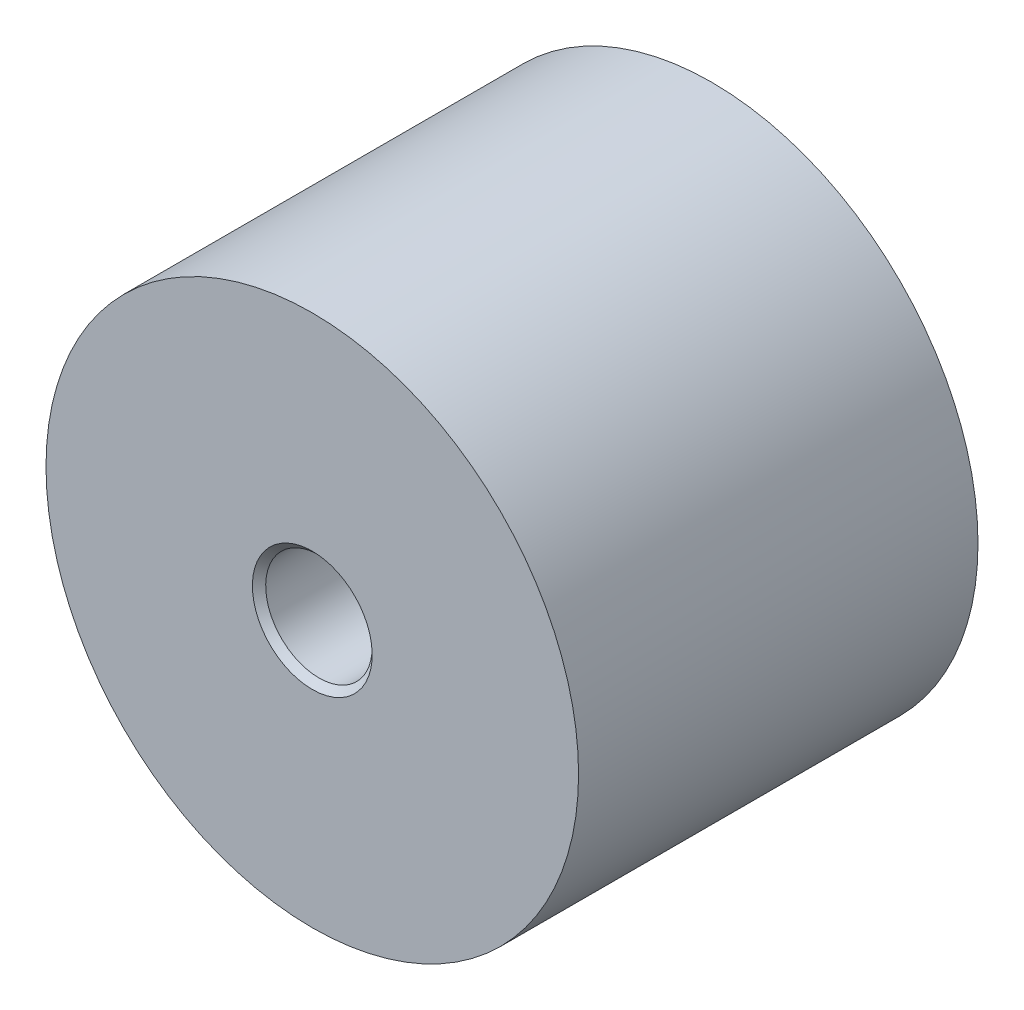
ISO-10303-21;
HEADER;
FILE_DESCRIPTION(('STEP AP214'),'2;1');
FILE_NAME('part.step','',(''),(''),'','','');
FILE_SCHEMA(('AUTOMOTIVE_DESIGN { 1 0 10303 214 1 1 1 1 }'));
ENDSEC;
DATA;
#1=APPLICATION_CONTEXT('core data for automotive mechanical design processes');
#2=APPLICATION_PROTOCOL_DEFINITION('international standard','automotive_design',2000,#1);
#3=PRODUCT_CONTEXT('',#1,'mechanical');
#4=PRODUCT('Part','Part','',(#3));
#5=PRODUCT_RELATED_PRODUCT_CATEGORY('part','',(#4));
#6=PRODUCT_DEFINITION_FORMATION('','',#4);
#7=PRODUCT_DEFINITION_CONTEXT('part definition',#1,'design');
#8=PRODUCT_DEFINITION('design','',#6,#7);
#9=PRODUCT_DEFINITION_SHAPE('','',#8);
#10=(LENGTH_UNIT() NAMED_UNIT(*) SI_UNIT(.MILLI.,.METRE.));
#11=(NAMED_UNIT(*) PLANE_ANGLE_UNIT() SI_UNIT($,.RADIAN.));
#12=(NAMED_UNIT(*) SI_UNIT($,.STERADIAN.) SOLID_ANGLE_UNIT());
#13=UNCERTAINTY_MEASURE_WITH_UNIT(LENGTH_MEASURE(1.E-05),#10,'distance_accuracy_value','');
#14=(GEOMETRIC_REPRESENTATION_CONTEXT(3) GLOBAL_UNCERTAINTY_ASSIGNED_CONTEXT((#13)) GLOBAL_UNIT_ASSIGNED_CONTEXT((#10,
#11,#12)) REPRESENTATION_CONTEXT('',''));
#15=CARTESIAN_POINT('',(0.,0.,0.));
#16=DIRECTION('',(0.,0.,1.));
#17=DIRECTION('',(1.,0.,0.));
#18=AXIS2_PLACEMENT_3D('',#15,#16,#17);
#19=CARTESIAN_POINT('',(18.666666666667,0.,30.));
#20=DIRECTION('',(0.,0.,1.));
#21=DIRECTION('',(0.,-1.,0.));
#22=AXIS2_PLACEMENT_3D('',#19,#20,#21);
#23=PLANE('',#22);
#24=CARTESIAN_POINT('',(0.,0.,30.));
#25=DIRECTION('',(0.,0.,1.));
#26=DIRECTION('',(0.,-1.,0.));
#27=AXIS2_PLACEMENT_3D('',#24,#25,#26);
#28=CIRCLE('',#27,4.5);
#29=CARTESIAN_POINT('',(0.,-4.5,30.));
#30=VERTEX_POINT('',#29);
#31=EDGE_CURVE('E8',#30,#30,#28,.F.);
#32=ORIENTED_EDGE('',*,*,#31,.T.);
#33=EDGE_LOOP('',(#32));
#34=FACE_BOUND('',#33,.T.);
#35=CARTESIAN_POINT('',(0.,0.,30.));
#36=DIRECTION('',(0.,0.,1.));
#37=DIRECTION('',(0.,-1.,0.));
#38=AXIS2_PLACEMENT_3D('',#35,#36,#37);
#39=CIRCLE('',#38,20.);
#40=CARTESIAN_POINT('',(0.,-20.,30.));
#41=VERTEX_POINT('',#40);
#42=EDGE_CURVE('E32',#41,#41,#39,.T.);
#43=ORIENTED_EDGE('',*,*,#42,.T.);
#44=EDGE_LOOP('',(#43));
#45=FACE_BOUND('',#44,.T.);
#46=ADVANCED_FACE('F12',(#34,#45),#23,.T.);
#47=CARTESIAN_POINT('',(0.,0.,1.));
#48=DIRECTION('',(0.,0.,1.));
#49=DIRECTION('',(0.,-1.,0.));
#50=AXIS2_PLACEMENT_3D('',#47,#48,#49);
#51=CYLINDRICAL_SURFACE('',#50,20.);
#52=CARTESIAN_POINT('',(0.,0.,0.));
#53=DIRECTION('',(0.,0.,1.));
#54=DIRECTION('',(0.,-1.,0.));
#55=AXIS2_PLACEMENT_3D('',#52,#53,#54);
#56=CIRCLE('',#55,20.);
#57=CARTESIAN_POINT('',(0.,-20.,0.));
#58=VERTEX_POINT('',#57);
#59=EDGE_CURVE('E35',#58,#58,#56,.T.);
#60=ORIENTED_EDGE('',*,*,#59,.T.);
#61=EDGE_LOOP('',(#60));
#62=FACE_BOUND('',#61,.T.);
#63=ORIENTED_EDGE('',*,*,#42,.F.);
#64=EDGE_LOOP('',(#63));
#65=FACE_BOUND('',#64,.T.);
#66=ADVANCED_FACE('F63',(#62,#65),#51,.T.);
#67=CARTESIAN_POINT('',(20.,0.,0.));
#68=DIRECTION('',(0.,0.,-1.));
#69=DIRECTION('',(0.,1.,0.));
#70=AXIS2_PLACEMENT_3D('',#67,#68,#69);
#71=PLANE('',#70);
#72=CARTESIAN_POINT('',(0.,0.,0.));
#73=DIRECTION('',(0.,0.,-1.));
#74=DIRECTION('',(0.,1.,0.));
#75=AXIS2_PLACEMENT_3D('',#72,#73,#74);
#76=CIRCLE('',#75,4.5);
#77=CARTESIAN_POINT('',(0.,4.5,0.));
#78=VERTEX_POINT('',#77);
#79=EDGE_CURVE('E23',#78,#78,#76,.F.);
#80=ORIENTED_EDGE('',*,*,#79,.T.);
#81=EDGE_LOOP('',(#80));
#82=FACE_BOUND('',#81,.T.);
#83=ORIENTED_EDGE('',*,*,#59,.F.);
#84=EDGE_LOOP('',(#83));
#85=FACE_BOUND('',#84,.T.);
#86=ADVANCED_FACE('F68',(#82,#85),#71,.T.);
#87=CARTESIAN_POINT('',(0.,0.,0.));
#88=DIRECTION('',(0.,0.,1.));
#89=DIRECTION('',(0.,-1.,0.));
#90=AXIS2_PLACEMENT_3D('',#87,#88,#89);
#91=CYLINDRICAL_SURFACE('',#90,4.);
#92=CARTESIAN_POINT('',(0.,0.,0.50000000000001));
#93=DIRECTION('',(0.,0.,-1.));
#94=DIRECTION('',(0.,1.,0.));
#95=AXIS2_PLACEMENT_3D('',#92,#93,#94);
#96=CIRCLE('',#95,4.);
#97=CARTESIAN_POINT('',(0.,4.,0.50000000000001));
#98=VERTEX_POINT('',#97);
#99=EDGE_CURVE('E27',#98,#98,#96,.T.);
#100=ORIENTED_EDGE('',*,*,#99,.T.);
#101=EDGE_LOOP('',(#100));
#102=FACE_BOUND('',#101,.T.);
#103=CARTESIAN_POINT('',(0.,0.,8.));
#104=DIRECTION('',(0.,0.,-1.));
#105=DIRECTION('',(0.,1.,0.));
#106=AXIS2_PLACEMENT_3D('',#103,#104,#105);
#107=CIRCLE('',#106,4.);
#108=CARTESIAN_POINT('',(0.,4.,8.));
#109=VERTEX_POINT('',#108);
#110=EDGE_CURVE('E38',#109,#109,#107,.T.);
#111=ORIENTED_EDGE('',*,*,#110,.F.);
#112=EDGE_LOOP('',(#111));
#113=FACE_BOUND('',#112,.T.);
#114=ADVANCED_FACE('F58',(#102,#113),#91,.F.);
#115=CARTESIAN_POINT('',(0.,0.,8.));
#116=DIRECTION('',(0.,0.,-1.));
#117=DIRECTION('',(0.,1.,0.));
#118=AXIS2_PLACEMENT_3D('',#115,#116,#117);
#119=PLANE('',#118);
#120=ORIENTED_EDGE('',*,*,#110,.T.);
#121=EDGE_LOOP('',(#120));
#122=FACE_BOUND('',#121,.T.);
#123=ADVANCED_FACE('F49',(#122),#119,.T.);
#124=CARTESIAN_POINT('',(0.,0.,24.666666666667));
#125=DIRECTION('',(0.,0.,1.));
#126=DIRECTION('',(0.,-1.,0.));
#127=AXIS2_PLACEMENT_3D('',#124,#125,#126);
#128=CYLINDRICAL_SURFACE('',#127,4.);
#129=CARTESIAN_POINT('',(0.,0.,29.5));
#130=DIRECTION('',(0.,0.,1.));
#131=DIRECTION('',(0.,-1.,0.));
#132=AXIS2_PLACEMENT_3D('',#129,#130,#131);
#133=CIRCLE('',#132,4.);
#134=CARTESIAN_POINT('',(0.,-4.,29.5));
#135=VERTEX_POINT('',#134);
#136=EDGE_CURVE('E19',#135,#135,#133,.T.);
#137=ORIENTED_EDGE('',*,*,#136,.T.);
#138=EDGE_LOOP('',(#137));
#139=FACE_BOUND('',#138,.T.);
#140=CARTESIAN_POINT('',(0.,0.,22.));
#141=DIRECTION('',(0.,0.,1.));
#142=DIRECTION('',(0.,-1.,0.));
#143=AXIS2_PLACEMENT_3D('',#140,#141,#142);
#144=CIRCLE('',#143,4.);
#145=CARTESIAN_POINT('',(0.,-4.,22.));
#146=VERTEX_POINT('',#145);
#147=EDGE_CURVE('E41',#146,#146,#144,.T.);
#148=ORIENTED_EDGE('',*,*,#147,.F.);
#149=EDGE_LOOP('',(#148));
#150=FACE_BOUND('',#149,.T.);
#151=ADVANCED_FACE('F47',(#139,#150),#128,.F.);
#152=CARTESIAN_POINT('',(0.,0.,22.));
#153=DIRECTION('',(0.,0.,1.));
#154=DIRECTION('',(0.,-1.,0.));
#155=AXIS2_PLACEMENT_3D('',#152,#153,#154);
#156=PLANE('',#155);
#157=ORIENTED_EDGE('',*,*,#147,.T.);
#158=EDGE_LOOP('',(#157));
#159=FACE_BOUND('',#158,.T.);
#160=ADVANCED_FACE('F45',(#159),#156,.T.);
#161=CARTESIAN_POINT('',(0.,0.,0.50000000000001));
#162=DIRECTION('',(0.,0.,-1.));
#163=DIRECTION('',(0.,1.,0.));
#164=AXIS2_PLACEMENT_3D('',#161,#162,#163);
#165=CONICAL_SURFACE('',#164,4.,0.785398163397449);
#166=ORIENTED_EDGE('',*,*,#79,.F.);
#167=EDGE_LOOP('',(#166));
#168=FACE_BOUND('',#167,.T.);
#169=ORIENTED_EDGE('',*,*,#99,.F.);
#170=EDGE_LOOP('',(#169));
#171=FACE_BOUND('',#170,.T.);
#172=ADVANCED_FACE('F56',(#168,#171),#165,.F.);
#173=CARTESIAN_POINT('',(0.,0.,29.5));
#174=DIRECTION('',(0.,0.,1.));
#175=DIRECTION('',(0.,-1.,0.));
#176=AXIS2_PLACEMENT_3D('',#173,#174,#175);
#177=CONICAL_SURFACE('',#176,4.,0.785398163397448);
#178=ORIENTED_EDGE('',*,*,#31,.F.);
#179=EDGE_LOOP('',(#178));
#180=FACE_BOUND('',#179,.T.);
#181=ORIENTED_EDGE('',*,*,#136,.F.);
#182=EDGE_LOOP('',(#181));
#183=FACE_BOUND('',#182,.T.);
#184=ADVANCED_FACE('F14',(#180,#183),#177,.F.);
#185=CLOSED_SHELL('',(#46,#66,#86,#114,#123,#151,#160,#172,#184));
#186=MANIFOLD_SOLID_BREP('B1',#185);
#187=ADVANCED_BREP_SHAPE_REPRESENTATION('',(#18,#186),#14);
#188=SHAPE_DEFINITION_REPRESENTATION(#9,#187);
ENDSEC;
END-ISO-10303-21;
